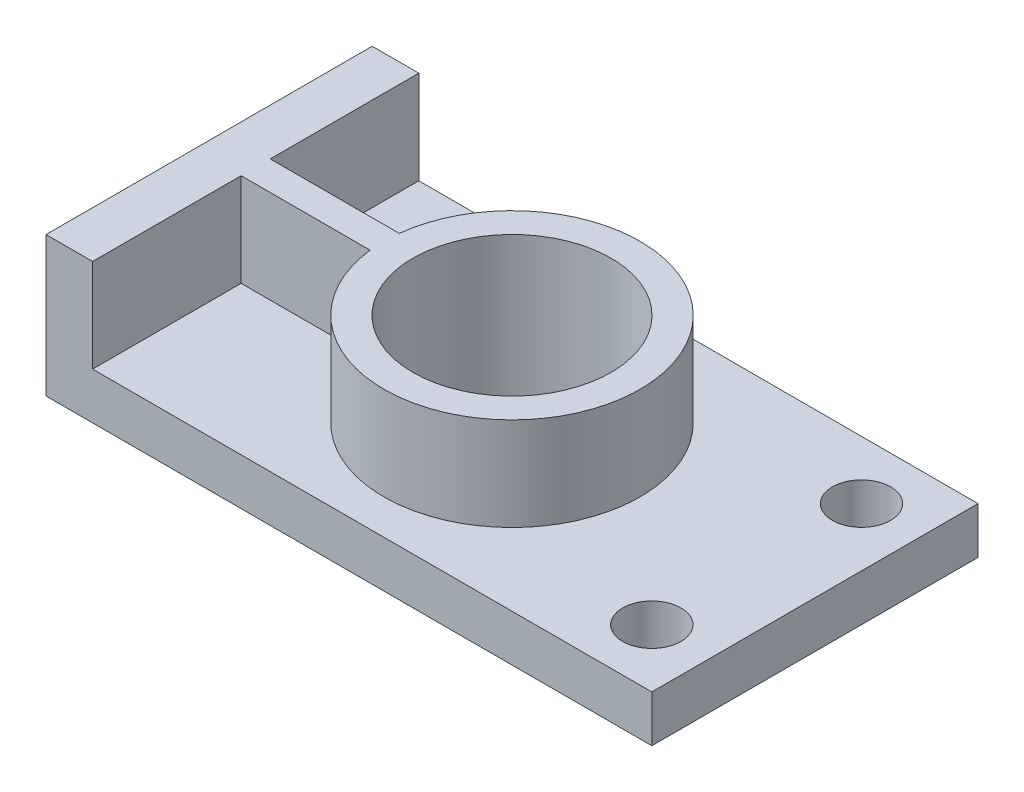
from build123d import *

# Parameters (mm, degrees)
BASE_EXTRUDE_THIN_DEPTH = 88.9
BOSS_EXTRUDE1_REACH     = 193.345
SKETCH2_R               = 34.925
SKETCH3_R               = 26.9875
CUT_EXTRUDE1_DEPTH      = 192.344793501
SKETCH4_R               = 7.9375
CUT_EXTRUDE2_DEPTH      = 190.225738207
RIB1_REACH              = 193.345
SKETCH5_WALLS_W         = 405.818012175
SKETCH5_WALLS_H         = 7.9375


with BuildPart() as part:
    # Sketch1 → Base-Extrude-Thin (new body)
    with BuildSketch(Plane.XY):
        Polygon((0, 38.1), (0, 0), (165.1, 0), (165.1, 12.7), (12.7, 12.7), (12.7, 38.1), align=None)
    extrude(amount=-BASE_EXTRUDE_THIN_DEPTH)

    # Sketch2 → Boss-Extrude1 (add, up to next)
    with BuildSketch(Plane(origin=(0, 38.1, 0), x_dir=(-1, 0, 0), z_dir=(0, 1, 0)), mode=Mode.PRIVATE) as boss_extrude1_sk1:
        with Locations(Location((-82.55, -44.45, 0), (0, 0, 90))):
            Circle(SKETCH2_R)
    boss_extrude1_tool1 = extrude(boss_extrude1_sk1.sketch, amount=-BOSS_EXTRUDE1_REACH, mode=Mode.PRIVATE) - part.part
    add(boss_extrude1_tool1.solids().sort_by_distance((82.55, 38.1, -44.45))[0])

    # Sketch3 → Cut-Extrude1 (cut, through all)
    with BuildSketch(Plane(origin=(0, 38.1, 0), x_dir=(-1, 0, 0), z_dir=(0, 1, 0))):
        with Locations(Location((-82.55, -44.45, 0), (0, 0, 90))):
            Circle(SKETCH3_R)
    extrude(amount=-CUT_EXTRUDE1_DEPTH, mode=Mode.SUBTRACT)

    # Sketch4 → Cut-Extrude2 (cut, through all)
    with BuildSketch(Plane(origin=(0, 12.7, 0), x_dir=(-1, 0, 0), z_dir=(0, 1, 0))):
        with Locations(Location((-149.225, -15.875, 0), (0, 0, 90))):
            Circle(SKETCH4_R)
        with Locations(Location((-149.225, -73.025, 0), (0, 0, 90))):
            Circle(SKETCH4_R)
    extrude(amount=-CUT_EXTRUDE2_DEPTH, mode=Mode.SUBTRACT)

    # Sketch5 walls → Rib1 (add, up to next)
    with BuildSketch(Plane(origin=(0, 38.1, 0), x_dir=(-1, 0, 0), z_dir=(0, 1, 0)), mode=Mode.PRIVATE) as rib1_sk1:
        with Locations((-32.214634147, -44.45)):
            Rectangle(SKETCH5_WALLS_W, SKETCH5_WALLS_H)
    rib1_tool1 = extrude(rib1_sk1.sketch, amount=-RIB1_REACH, mode=Mode.PRIVATE) - part.part
    add(rib1_tool1.solids().sort_by_distance((32.214634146, 38.1, -44.45))[0])


solid = part.part
